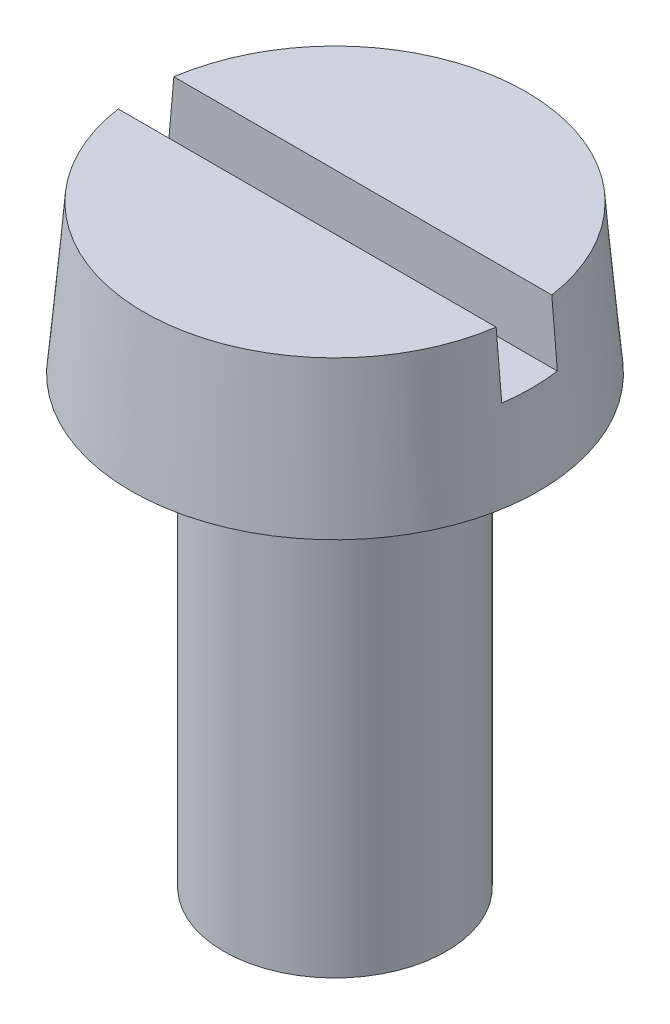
ISO-10303-21;
HEADER;
FILE_DESCRIPTION(('STEP AP214'),'2;1');
FILE_NAME('part.step','',(''),(''),'','','');
FILE_SCHEMA(('AUTOMOTIVE_DESIGN { 1 0 10303 214 1 1 1 1 }'));
ENDSEC;
DATA;
#1=APPLICATION_CONTEXT('core data for automotive mechanical design processes');
#2=APPLICATION_PROTOCOL_DEFINITION('international standard','automotive_design',2000,#1);
#3=PRODUCT_CONTEXT('',#1,'mechanical');
#4=PRODUCT('Part','Part','',(#3));
#5=PRODUCT_RELATED_PRODUCT_CATEGORY('part','',(#4));
#6=PRODUCT_DEFINITION_FORMATION('','',#4);
#7=PRODUCT_DEFINITION_CONTEXT('part definition',#1,'design');
#8=PRODUCT_DEFINITION('design','',#6,#7);
#9=PRODUCT_DEFINITION_SHAPE('','',#8);
#10=(LENGTH_UNIT() NAMED_UNIT(*) SI_UNIT(.MILLI.,.METRE.));
#11=(NAMED_UNIT(*) PLANE_ANGLE_UNIT() SI_UNIT($,.RADIAN.));
#12=(NAMED_UNIT(*) SI_UNIT($,.STERADIAN.) SOLID_ANGLE_UNIT());
#13=UNCERTAINTY_MEASURE_WITH_UNIT(LENGTH_MEASURE(1.E-05),#10,'distance_accuracy_value','');
#14=(GEOMETRIC_REPRESENTATION_CONTEXT(3) GLOBAL_UNCERTAINTY_ASSIGNED_CONTEXT((#13)) GLOBAL_UNIT_ASSIGNED_CONTEXT((#10,
#11,#12)) REPRESENTATION_CONTEXT('',''));
#15=CARTESIAN_POINT('',(0.,0.,0.));
#16=DIRECTION('',(0.,0.,1.));
#17=DIRECTION('',(1.,0.,0.));
#18=AXIS2_PLACEMENT_3D('',#15,#16,#17);
#19=CARTESIAN_POINT('',(3.30000000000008,1.14999999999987,0.375000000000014));
#20=DIRECTION('',(0.,-1.,0.));
#21=DIRECTION('',(0.,0.,-1.));
#22=AXIS2_PLACEMENT_3D('',#19,#20,#21);
#23=PLANE('',#22);
#24=CARTESIAN_POINT('',(0.,1.14999999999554,0.));
#25=DIRECTION('',(0.,-1.,0.));
#26=DIRECTION('',(0.,0.,-1.));
#27=AXIS2_PLACEMENT_3D('',#24,#25,#26);
#28=CIRCLE('',#27,2.64938803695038);
#29=CARTESIAN_POINT('',(-2.62271461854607,1.14999999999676,0.374999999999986));
#30=VERTEX_POINT('',#29);
#31=CARTESIAN_POINT('',(-2.62271461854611,1.14999999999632,-0.374999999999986));
#32=VERTEX_POINT('',#31);
#33=EDGE_CURVE('E70',#30,#32,#28,.T.);
#34=ORIENTED_EDGE('',*,*,#33,.F.);
#35=DIRECTION('',(1.,0.,0.));
#36=VECTOR('',#35,1.);
#37=CARTESIAN_POINT('',(3.30000000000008,1.14999999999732,0.374999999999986));
#38=LINE('',#37,#36);
#39=CARTESIAN_POINT('',(2.6227146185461,1.14999999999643,0.374999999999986));
#40=VERTEX_POINT('',#39);
#41=EDGE_CURVE('E68',#30,#40,#38,.T.);
#42=ORIENTED_EDGE('',*,*,#41,.T.);
#43=CARTESIAN_POINT('',(0.,1.14999999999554,0.));
#44=DIRECTION('',(0.,-1.,0.));
#45=DIRECTION('',(0.,0.,-1.));
#46=AXIS2_PLACEMENT_3D('',#43,#44,#45);
#47=CIRCLE('',#46,2.64938803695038);
#48=CARTESIAN_POINT('',(2.62271461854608,1.14999999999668,-0.374999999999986));
#49=VERTEX_POINT('',#48);
#50=EDGE_CURVE('E19',#49,#40,#47,.T.);
#51=ORIENTED_EDGE('',*,*,#50,.F.);
#52=DIRECTION('',(1.,0.,0.));
#53=VECTOR('',#52,1.);
#54=CARTESIAN_POINT('',(3.30000000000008,1.1499999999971,-0.374999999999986));
#55=LINE('',#54,#53);
#56=EDGE_CURVE('E63',#49,#32,#55,.F.);
#57=ORIENTED_EDGE('',*,*,#56,.T.);
#58=EDGE_LOOP('',(#34,#42,#51,#57));
#59=FACE_BOUND('',#58,.T.);
#60=ADVANCED_FACE('F16',(#59),#23,.F.);
#61=CARTESIAN_POINT('',(3.30000000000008,2.,0.374999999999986));
#62=DIRECTION('',(0.,0.,1.));
#63=DIRECTION('',(0.,-1.,0.));
#64=AXIS2_PLACEMENT_3D('',#61,#62,#63);
#65=PLANE('',#64);
#66=DIRECTION('',(1.,0.,0.));
#67=VECTOR('',#66,1.);
#68=CARTESIAN_POINT('',(2.77555756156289E-13,1.99999999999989,0.374999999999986));
#69=LINE('',#68,#67);
#70=CARTESIAN_POINT('',(-2.54757075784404,2.00000000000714,0.374999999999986));
#71=VERTEX_POINT('',#70);
#72=CARTESIAN_POINT('',(2.54757075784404,2.00000000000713,0.374999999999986));
#73=VERTEX_POINT('',#72);
#74=EDGE_CURVE('E72',#71,#73,#69,.T.);
#75=ORIENTED_EDGE('',*,*,#74,.T.);
#76=CARTESIAN_POINT('',(2.62271461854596,1.14999999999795,0.374999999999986));
#77=CARTESIAN_POINT('',(2.61019436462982,1.29166699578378,0.374999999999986));
#78=CARTESIAN_POINT('',(2.59767224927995,1.43333382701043,0.374999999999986));
#79=CARTESIAN_POINT('',(2.57262429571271,1.71666716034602,0.374999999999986));
#80=CARTESIAN_POINT('',(2.56009845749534,1.85833366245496,0.374999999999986));
#81=CARTESIAN_POINT('',(2.54757075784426,2.00000000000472,0.374999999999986));
#82=B_SPLINE_CURVE_WITH_KNOTS('',3,(#76,#77,#78,#79,#80,#81),.UNSPECIFIED.,.F.,.F.,(4,2,4),(0.,
0.426657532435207,0.853315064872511),.UNSPECIFIED.);
#83=EDGE_CURVE('E79',#40,#73,#82,.T.);
#84=ORIENTED_EDGE('',*,*,#83,.F.);
#85=ORIENTED_EDGE('',*,*,#41,.F.);
#86=CARTESIAN_POINT('',(-2.54757075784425,2.00000000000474,0.374999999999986));
#87=CARTESIAN_POINT('',(-2.56009845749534,1.85833366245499,0.374999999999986));
#88=CARTESIAN_POINT('',(-2.57262429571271,1.71666716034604,0.374999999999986));
#89=CARTESIAN_POINT('',(-2.59767224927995,1.43333382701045,0.374999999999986));
#90=CARTESIAN_POINT('',(-2.61019436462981,1.29166699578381,0.374999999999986));
#91=CARTESIAN_POINT('',(-2.62271461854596,1.14999999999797,0.374999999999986));
#92=B_SPLINE_CURVE_WITH_KNOTS('',3,(#86,#87,#88,#89,#90,#91),.UNSPECIFIED.,.F.,.F.,(4,2,4),(0.,
0.426657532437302,0.853315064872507),.UNSPECIFIED.);
#93=EDGE_CURVE('E110',#71,#30,#92,.T.);
#94=ORIENTED_EDGE('',*,*,#93,.F.);
#95=EDGE_LOOP('',(#75,#84,#85,#94));
#96=FACE_BOUND('',#95,.T.);
#97=ADVANCED_FACE('F119',(#96),#65,.F.);
#98=CARTESIAN_POINT('',(3.30000000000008,1.14999999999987,-0.374999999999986));
#99=DIRECTION('',(0.,0.,-1.));
#100=DIRECTION('',(0.,1.,0.));
#101=AXIS2_PLACEMENT_3D('',#98,#99,#100);
#102=PLANE('',#101);
#103=CARTESIAN_POINT('',(2.54757075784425,2.00000000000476,-0.374999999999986));
#104=CARTESIAN_POINT('',(2.56009845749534,1.85833366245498,-0.374999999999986));
#105=CARTESIAN_POINT('',(2.57262429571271,1.716667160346,-0.374999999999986));
#106=CARTESIAN_POINT('',(2.59767224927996,1.43333382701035,-0.374999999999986));
#107=CARTESIAN_POINT('',(2.61019436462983,1.29166699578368,-0.374999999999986));
#108=CARTESIAN_POINT('',(2.62271461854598,1.14999999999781,-0.374999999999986));
#109=B_SPLINE_CURVE_WITH_KNOTS('',3,(#103,#104,#105,#106,#107,#108),.UNSPECIFIED.,.F.,.F.,(4,2,
4),(0.,0.426657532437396,0.853315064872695),.UNSPECIFIED.);
#110=CARTESIAN_POINT('',(2.54757075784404,2.00000000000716,-0.374999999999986));
#111=VERTEX_POINT('',#110);
#112=EDGE_CURVE('E52',#111,#49,#109,.T.);
#113=ORIENTED_EDGE('',*,*,#112,.F.);
#114=DIRECTION('',(1.,0.,0.));
#115=VECTOR('',#114,1.);
#116=CARTESIAN_POINT('',(2.77555756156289E-13,1.99999999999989,-0.374999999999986));
#117=LINE('',#116,#115);
#118=CARTESIAN_POINT('',(-2.54757075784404,2.00000000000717,-0.374999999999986));
#119=VERTEX_POINT('',#118);
#120=EDGE_CURVE('E75',#111,#119,#117,.F.);
#121=ORIENTED_EDGE('',*,*,#120,.T.);
#122=CARTESIAN_POINT('',(-2.62271461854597,1.14999999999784,-0.374999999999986));
#123=CARTESIAN_POINT('',(-2.61019436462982,1.2916669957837,-0.374999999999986));
#124=CARTESIAN_POINT('',(-2.59767224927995,1.43333382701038,-0.374999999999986));
#125=CARTESIAN_POINT('',(-2.57262429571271,1.71666716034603,-0.374999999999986));
#126=CARTESIAN_POINT('',(-2.56009845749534,1.858333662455,-0.374999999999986));
#127=CARTESIAN_POINT('',(-2.54757075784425,2.00000000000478,-0.374999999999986));
#128=B_SPLINE_CURVE_WITH_KNOTS('',3,(#122,#123,#124,#125,#126,#127),.UNSPECIFIED.,.F.,.F.,(4,2,
4),(0.,0.426657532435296,0.85331506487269),.UNSPECIFIED.);
#129=EDGE_CURVE('E34',#32,#119,#128,.T.);
#130=ORIENTED_EDGE('',*,*,#129,.F.);
#131=ORIENTED_EDGE('',*,*,#56,.F.);
#132=EDGE_LOOP('',(#113,#121,#130,#131));
#133=FACE_BOUND('',#132,.T.);
#134=ADVANCED_FACE('F71',(#133),#102,.F.);
#135=CARTESIAN_POINT('',(2.77555756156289E-13,1.99999999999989,0.));
#136=DIRECTION('',(0.,-1.,0.));
#137=DIRECTION('',(0.,0.,-1.));
#138=AXIS2_PLACEMENT_3D('',#135,#136,#137);
#139=PLANE('',#138);
#140=CARTESIAN_POINT('',(0.,2.00000000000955,0.));
#141=DIRECTION('',(0.,-1.,0.));
#142=DIRECTION('',(0.,0.,-1.));
#143=AXIS2_PLACEMENT_3D('',#140,#141,#142);
#144=CIRCLE('',#143,2.5750226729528);
#145=EDGE_CURVE('E87',#73,#71,#144,.T.);
#146=ORIENTED_EDGE('',*,*,#145,.F.);
#147=ORIENTED_EDGE('',*,*,#74,.F.);
#148=EDGE_LOOP('',(#146,#147));
#149=FACE_BOUND('',#148,.T.);
#150=ADVANCED_FACE('F129',(#149),#139,.F.);
#151=CARTESIAN_POINT('',(2.77555756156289E-13,1.99999999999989,0.));
#152=DIRECTION('',(0.,-1.,0.));
#153=DIRECTION('',(0.,0.,-1.));
#154=AXIS2_PLACEMENT_3D('',#151,#152,#153);
#155=PLANE('',#154);
#156=ORIENTED_EDGE('',*,*,#120,.F.);
#157=CARTESIAN_POINT('',(0.,2.00000000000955,0.));
#158=DIRECTION('',(0.,-1.,0.));
#159=DIRECTION('',(0.,0.,-1.));
#160=AXIS2_PLACEMENT_3D('',#157,#158,#159);
#161=CIRCLE('',#160,2.5750226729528);
#162=EDGE_CURVE('E59',#119,#111,#161,.T.);
#163=ORIENTED_EDGE('',*,*,#162,.F.);
#164=EDGE_LOOP('',(#156,#163));
#165=FACE_BOUND('',#164,.T.);
#166=ADVANCED_FACE('F106',(#165),#155,.F.);
#167=CARTESIAN_POINT('',(0.,5.6843418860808E-11,0.));
#168=DIRECTION('',(0.,-1.,0.));
#169=DIRECTION('',(0.,0.,-1.));
#170=AXIS2_PLACEMENT_3D('',#167,#168,#169);
#171=CONICAL_SURFACE('',#170,2.74999999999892,0.0872664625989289);
#172=ORIENTED_EDGE('',*,*,#83,.T.);
#173=ORIENTED_EDGE('',*,*,#145,.T.);
#174=ORIENTED_EDGE('',*,*,#93,.T.);
#175=ORIENTED_EDGE('',*,*,#33,.T.);
#176=ORIENTED_EDGE('',*,*,#129,.T.);
#177=ORIENTED_EDGE('',*,*,#162,.T.);
#178=ORIENTED_EDGE('',*,*,#112,.T.);
#179=ORIENTED_EDGE('',*,*,#50,.T.);
#180=EDGE_LOOP('',(#172,#173,#174,#175,#176,#177,#178,#179));
#181=FACE_BOUND('',#180,.T.);
#182=CARTESIAN_POINT('',(0.,0.,0.));
#183=DIRECTION('',(0.,-1.,0.));
#184=DIRECTION('',(0.,0.,-1.));
#185=AXIS2_PLACEMENT_3D('',#182,#183,#184);
#186=CIRCLE('',#185,2.75000000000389);
#187=CARTESIAN_POINT('',(0.,0.,-2.75000000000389));
#188=VERTEX_POINT('',#187);
#189=EDGE_CURVE('E83',#188,#188,#186,.T.);
#190=ORIENTED_EDGE('',*,*,#189,.F.);
#191=EDGE_LOOP('',(#190));
#192=FACE_BOUND('',#191,.T.);
#193=ADVANCED_FACE('F55',(#181,#192),#171,.T.);
#194=CARTESIAN_POINT('',(0.,0.,0.));
#195=DIRECTION('',(0.,-1.,0.));
#196=DIRECTION('',(0.,0.,-1.));
#197=AXIS2_PLACEMENT_3D('',#194,#195,#196);
#198=PLANE('',#197);
#199=ORIENTED_EDGE('',*,*,#189,.T.);
#200=EDGE_LOOP('',(#199));
#201=FACE_BOUND('',#200,.T.);
#202=CARTESIAN_POINT('',(2.22044604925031E-13,0.,0.));
#203=DIRECTION('',(0.,-1.,0.));
#204=DIRECTION('',(0.,0.,-1.));
#205=AXIS2_PLACEMENT_3D('',#202,#203,#204);
#206=CIRCLE('',#205,1.5);
#207=CARTESIAN_POINT('',(2.22044604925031E-13,0.,-1.5));
#208=VERTEX_POINT('',#207);
#209=EDGE_CURVE('E25',#208,#208,#206,.T.);
#210=ORIENTED_EDGE('',*,*,#209,.F.);
#211=EDGE_LOOP('',(#210));
#212=FACE_BOUND('',#211,.T.);
#213=ADVANCED_FACE('F105',(#201,#212),#198,.T.);
#214=CARTESIAN_POINT('',(2.22044604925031E-13,-6.00000000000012,0.));
#215=DIRECTION('',(0.,-1.,0.));
#216=DIRECTION('',(0.,0.,-1.));
#217=AXIS2_PLACEMENT_3D('',#214,#215,#216);
#218=PLANE('',#217);
#219=CARTESIAN_POINT('',(2.22044604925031E-13,-6.00000000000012,0.));
#220=DIRECTION('',(0.,-1.,0.));
#221=DIRECTION('',(0.,0.,-1.));
#222=AXIS2_PLACEMENT_3D('',#219,#220,#221);
#223=CIRCLE('',#222,1.5);
#224=CARTESIAN_POINT('',(2.22044604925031E-13,-6.00000000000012,-1.5));
#225=VERTEX_POINT('',#224);
#226=EDGE_CURVE('E11',#225,#225,#223,.F.);
#227=ORIENTED_EDGE('',*,*,#226,.F.);
#228=EDGE_LOOP('',(#227));
#229=FACE_BOUND('',#228,.T.);
#230=ADVANCED_FACE('F132',(#229),#218,.T.);
#231=CARTESIAN_POINT('',(2.22044604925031E-13,2.39999999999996,0.));
#232=DIRECTION('',(0.,-1.,0.));
#233=DIRECTION('',(0.,0.,-1.));
#234=AXIS2_PLACEMENT_3D('',#231,#232,#233);
#235=CYLINDRICAL_SURFACE('',#234,1.5);
#236=ORIENTED_EDGE('',*,*,#226,.T.);
#237=EDGE_LOOP('',(#236));
#238=FACE_BOUND('',#237,.T.);
#239=ORIENTED_EDGE('',*,*,#209,.T.);
#240=EDGE_LOOP('',(#239));
#241=FACE_BOUND('',#240,.T.);
#242=ADVANCED_FACE('F130',(#238,#241),#235,.T.);
#243=CLOSED_SHELL('',(#60,#97,#134,#150,#166,#193,#213,#230,#242));
#244=MANIFOLD_SOLID_BREP('B1',#243);
#245=ADVANCED_BREP_SHAPE_REPRESENTATION('',(#18,#244),#14);
#246=SHAPE_DEFINITION_REPRESENTATION(#9,#245);
ENDSEC;
END-ISO-10303-21;
